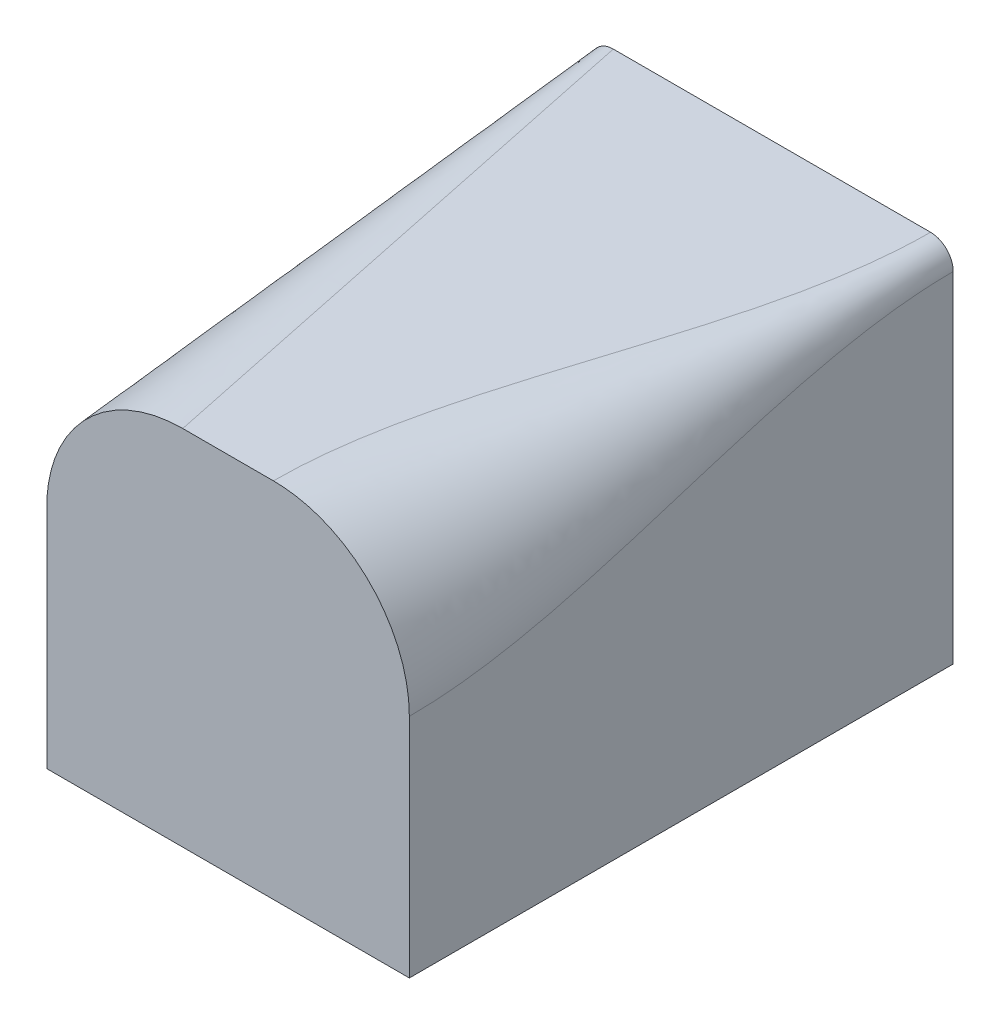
ISO-10303-21;
HEADER;
FILE_DESCRIPTION(('STEP AP214'),'2;1');
FILE_NAME('part.step','',(''),(''),'','','');
FILE_SCHEMA(('AUTOMOTIVE_DESIGN { 1 0 10303 214 1 1 1 1 }'));
ENDSEC;
DATA;
#1=APPLICATION_CONTEXT('core data for automotive mechanical design processes');
#2=APPLICATION_PROTOCOL_DEFINITION('international standard','automotive_design',2000,#1);
#3=PRODUCT_CONTEXT('',#1,'mechanical');
#4=PRODUCT('Part','Part','',(#3));
#5=PRODUCT_RELATED_PRODUCT_CATEGORY('part','',(#4));
#6=PRODUCT_DEFINITION_FORMATION('','',#4);
#7=PRODUCT_DEFINITION_CONTEXT('part definition',#1,'design');
#8=PRODUCT_DEFINITION('design','',#6,#7);
#9=PRODUCT_DEFINITION_SHAPE('','',#8);
#10=(LENGTH_UNIT() NAMED_UNIT(*) SI_UNIT(.MILLI.,.METRE.));
#11=(NAMED_UNIT(*) PLANE_ANGLE_UNIT() SI_UNIT($,.RADIAN.));
#12=(NAMED_UNIT(*) SI_UNIT($,.STERADIAN.) SOLID_ANGLE_UNIT());
#13=UNCERTAINTY_MEASURE_WITH_UNIT(LENGTH_MEASURE(1.E-05),#10,'distance_accuracy_value','');
#14=(GEOMETRIC_REPRESENTATION_CONTEXT(3) GLOBAL_UNCERTAINTY_ASSIGNED_CONTEXT((#13)) GLOBAL_UNIT_ASSIGNED_CONTEXT((#10,
#11,#12)) REPRESENTATION_CONTEXT('',''));
#15=CARTESIAN_POINT('',(0.,0.,0.));
#16=DIRECTION('',(0.,0.,1.));
#17=DIRECTION('',(1.,0.,0.));
#18=AXIS2_PLACEMENT_3D('',#15,#16,#17);
#19=CARTESIAN_POINT('',(25.4,0.,76.2));
#20=DIRECTION('',(-1.,0.,0.));
#21=DIRECTION('',(0.,-1.,0.));
#22=AXIS2_PLACEMENT_3D('',#19,#20,#21);
#23=PLANE('',#22);
#24=DIRECTION('',(0.,1.,0.));
#25=VECTOR('',#24,1.);
#26=CARTESIAN_POINT('',(25.4,0.,0.));
#27=LINE('',#26,#25);
#28=CARTESIAN_POINT('',(25.4,-50.8,0.));
#29=VERTEX_POINT('',#28);
#30=CARTESIAN_POINT('',(25.4,-3.17500000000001,0.));
#31=VERTEX_POINT('',#30);
#32=EDGE_CURVE('E124',#29,#31,#27,.T.);
#33=ORIENTED_EDGE('',*,*,#32,.T.);
#34=CARTESIAN_POINT('',(25.4,-19.05,228.6));
#35=CARTESIAN_POINT('',(25.4,-19.05,177.8));
#36=CARTESIAN_POINT('',(25.4,-19.05,127.));
#37=CARTESIAN_POINT('',(25.4,-19.05,76.2));
#38=CARTESIAN_POINT('',(25.4,-19.05,50.8));
#39=CARTESIAN_POINT('',(25.4,-3.17500000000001,25.4));
#40=CARTESIAN_POINT('',(25.4,-3.17500000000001,0.));
#41=CARTESIAN_POINT('',(25.4,-3.17500000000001,-50.7999999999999));
#42=CARTESIAN_POINT('',(25.4,-3.17500000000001,-101.6));
#43=CARTESIAN_POINT('',(25.4,-3.17500000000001,-152.4));
#44=(BOUNDED_CURVE() B_SPLINE_CURVE(3,(#34,#35,#36,#37,#38,#39,#40,#41,#42,#43),.UNSPECIFIED.,
.F.,.F.) B_SPLINE_CURVE_WITH_KNOTS((4,3,3,4),(-0.1524,0.,0.0762,0.2286),
.UNSPECIFIED.) CURVE() GEOMETRIC_REPRESENTATION_ITEM() RATIONAL_B_SPLINE_CURVE((1.,1.,1.,1.,1.,
1.,1.,1.,1.,1.)) REPRESENTATION_ITEM(''));
#45=CARTESIAN_POINT('',(25.4,-19.05,76.2));
#46=VERTEX_POINT('',#45);
#47=EDGE_CURVE('E51',#31,#46,#44,.F.);
#48=ORIENTED_EDGE('',*,*,#47,.T.);
#49=DIRECTION('',(0.,1.,0.));
#50=VECTOR('',#49,1.);
#51=CARTESIAN_POINT('',(25.4,0.,76.2));
#52=LINE('',#51,#50);
#53=CARTESIAN_POINT('',(25.4,-50.8,76.2));
#54=VERTEX_POINT('',#53);
#55=EDGE_CURVE('E130',#54,#46,#52,.T.);
#56=ORIENTED_EDGE('',*,*,#55,.F.);
#57=DIRECTION('',(0.,0.,-1.));
#58=VECTOR('',#57,1.);
#59=CARTESIAN_POINT('',(25.4,-50.8,76.2));
#60=LINE('',#59,#58);
#61=EDGE_CURVE('E116',#54,#29,#60,.T.);
#62=ORIENTED_EDGE('',*,*,#61,.T.);
#63=EDGE_LOOP('',(#33,#48,#56,#62));
#64=FACE_BOUND('',#63,.T.);
#65=ADVANCED_FACE('F34',(#64),#23,.F.);
#66=CARTESIAN_POINT('',(25.4,0.,76.2));
#67=DIRECTION('',(0.,-1.,0.));
#68=DIRECTION('',(1.,0.,0.));
#69=AXIS2_PLACEMENT_3D('',#66,#67,#68);
#70=PLANE('',#69);
#71=DIRECTION('',(-1.,0.,0.));
#72=VECTOR('',#71,1.);
#73=CARTESIAN_POINT('',(25.4,0.,76.2));
#74=LINE('',#73,#72);
#75=CARTESIAN_POINT('',(6.35000000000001,0.,76.2));
#76=VERTEX_POINT('',#75);
#77=CARTESIAN_POINT('',(-6.35,0.,76.2));
#78=VERTEX_POINT('',#77);
#79=EDGE_CURVE('E106',#76,#78,#74,.T.);
#80=ORIENTED_EDGE('',*,*,#79,.F.);
#81=CARTESIAN_POINT('',(6.35000000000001,0.,228.6));
#82=CARTESIAN_POINT('',(6.35000000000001,0.,177.8));
#83=CARTESIAN_POINT('',(6.35000000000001,0.,127.));
#84=CARTESIAN_POINT('',(6.35000000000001,0.,76.2));
#85=CARTESIAN_POINT('',(6.35000000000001,0.,50.8));
#86=CARTESIAN_POINT('',(22.225,0.,25.4));
#87=CARTESIAN_POINT('',(22.225,0.,0.));
#88=CARTESIAN_POINT('',(22.225,0.,-50.7999999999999));
#89=CARTESIAN_POINT('',(22.225,0.,-101.6));
#90=CARTESIAN_POINT('',(22.225,0.,-152.4));
#91=(BOUNDED_CURVE() B_SPLINE_CURVE(3,(#81,#82,#83,#84,#85,#86,#87,#88,#89,#90),.UNSPECIFIED.,
.F.,.F.) B_SPLINE_CURVE_WITH_KNOTS((4,3,3,4),(-0.1524,0.,0.0762,0.2286),
.UNSPECIFIED.) CURVE() GEOMETRIC_REPRESENTATION_ITEM() RATIONAL_B_SPLINE_CURVE((1.,1.,1.,1.,1.,
1.,1.,1.,1.,1.)) REPRESENTATION_ITEM(''));
#92=CARTESIAN_POINT('',(22.225,0.,0.));
#93=VERTEX_POINT('',#92);
#94=EDGE_CURVE('E175',#76,#93,#91,.T.);
#95=ORIENTED_EDGE('',*,*,#94,.T.);
#96=DIRECTION('',(-1.,0.,0.));
#97=VECTOR('',#96,1.);
#98=CARTESIAN_POINT('',(25.4,0.,0.));
#99=LINE('',#98,#97);
#100=CARTESIAN_POINT('',(-22.225,0.,0.));
#101=VERTEX_POINT('',#100);
#102=EDGE_CURVE('E126',#93,#101,#99,.T.);
#103=ORIENTED_EDGE('',*,*,#102,.T.);
#104=CARTESIAN_POINT('',(25.4,0.,228.6));
#105=CARTESIAN_POINT('',(14.8166666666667,0.,177.8));
#106=CARTESIAN_POINT('',(4.23333333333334,0.,127.));
#107=CARTESIAN_POINT('',(-6.35,0.,76.2));
#108=CARTESIAN_POINT('',(-11.6416666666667,0.,50.8));
#109=CARTESIAN_POINT('',(-16.9333333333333,0.,25.4));
#110=CARTESIAN_POINT('',(-22.225,0.,0.));
#111=CARTESIAN_POINT('',(-23.2833333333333,0.,-5.07999999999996));
#112=CARTESIAN_POINT('',(-24.3416666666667,0.,-10.16));
#113=CARTESIAN_POINT('',(-25.4,0.,-15.24));
#114=(BOUNDED_CURVE() B_SPLINE_CURVE(3,(#104,#105,#106,#107,#108,#109,#110,#111,#112,#113),
.UNSPECIFIED.,.F.,.F.) B_SPLINE_CURVE_WITH_KNOTS((4,3,3,4),(-0.1524,0.,0.0762,0.09144),
.UNSPECIFIED.) CURVE() GEOMETRIC_REPRESENTATION_ITEM() RATIONAL_B_SPLINE_CURVE((1.,1.,1.,1.,1.,
1.,1.,1.,1.,1.)) REPRESENTATION_ITEM(''));
#115=EDGE_CURVE('E146',#101,#78,#114,.F.);
#116=ORIENTED_EDGE('',*,*,#115,.T.);
#117=EDGE_LOOP('',(#80,#95,#103,#116));
#118=FACE_BOUND('',#117,.T.);
#119=ADVANCED_FACE('F187',(#118),#70,.F.);
#120=CARTESIAN_POINT('',(-25.4,0.,76.2));
#121=DIRECTION('',(1.,0.,0.));
#122=DIRECTION('',(0.,1.,0.));
#123=AXIS2_PLACEMENT_3D('',#120,#121,#122);
#124=PLANE('',#123);
#125=DIRECTION('',(0.,-1.,0.));
#126=VECTOR('',#125,1.);
#127=CARTESIAN_POINT('',(-25.4,0.,76.2));
#128=LINE('',#127,#126);
#129=CARTESIAN_POINT('',(-25.4,-19.05,76.2));
#130=VERTEX_POINT('',#129);
#131=CARTESIAN_POINT('',(-25.4,-50.8,76.2));
#132=VERTEX_POINT('',#131);
#133=EDGE_CURVE('E95',#130,#132,#128,.T.);
#134=ORIENTED_EDGE('',*,*,#133,.F.);
#135=CARTESIAN_POINT('',(-25.4,-50.8,228.6));
#136=CARTESIAN_POINT('',(-25.4,-40.2166666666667,177.8));
#137=CARTESIAN_POINT('',(-25.4,-29.6333333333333,127.));
#138=CARTESIAN_POINT('',(-25.4,-19.05,76.2));
#139=CARTESIAN_POINT('',(-25.4,-13.7583333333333,50.8));
#140=CARTESIAN_POINT('',(-25.4,-8.46666666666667,25.4));
#141=CARTESIAN_POINT('',(-25.4,-3.175,0.));
#142=CARTESIAN_POINT('',(-25.4,-2.11666666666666,-5.07999999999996));
#143=CARTESIAN_POINT('',(-25.4,-1.05833333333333,-10.16));
#144=CARTESIAN_POINT('',(-25.4,0.,-15.24));
#145=(BOUNDED_CURVE() B_SPLINE_CURVE(3,(#135,#136,#137,#138,#139,#140,#141,#142,#143,#144),
.UNSPECIFIED.,.F.,.F.) B_SPLINE_CURVE_WITH_KNOTS((4,3,3,4),(-0.1524,0.,0.0762,0.09144),
.UNSPECIFIED.) CURVE() GEOMETRIC_REPRESENTATION_ITEM() RATIONAL_B_SPLINE_CURVE((1.,1.,1.,1.,1.,
1.,1.,1.,1.,1.)) REPRESENTATION_ITEM(''));
#146=CARTESIAN_POINT('',(-25.4,-3.175,0.));
#147=VERTEX_POINT('',#146);
#148=EDGE_CURVE('E115',#130,#147,#145,.T.);
#149=ORIENTED_EDGE('',*,*,#148,.T.);
#150=DIRECTION('',(0.,-1.,0.));
#151=VECTOR('',#150,1.);
#152=CARTESIAN_POINT('',(-25.4,0.,0.));
#153=LINE('',#152,#151);
#154=CARTESIAN_POINT('',(-25.4,-50.8,0.));
#155=VERTEX_POINT('',#154);
#156=EDGE_CURVE('E112',#147,#155,#153,.T.);
#157=ORIENTED_EDGE('',*,*,#156,.T.);
#158=DIRECTION('',(0.,0.,-1.));
#159=VECTOR('',#158,1.);
#160=CARTESIAN_POINT('',(-25.4,-50.8,76.2));
#161=LINE('',#160,#159);
#162=EDGE_CURVE('E109',#132,#155,#161,.T.);
#163=ORIENTED_EDGE('',*,*,#162,.F.);
#164=EDGE_LOOP('',(#134,#149,#157,#163));
#165=FACE_BOUND('',#164,.T.);
#166=ADVANCED_FACE('F110',(#165),#124,.F.);
#167=CARTESIAN_POINT('',(25.4,-50.8,76.2));
#168=DIRECTION('',(0.,1.,0.));
#169=DIRECTION('',(0.,0.,1.));
#170=AXIS2_PLACEMENT_3D('',#167,#168,#169);
#171=PLANE('',#170);
#172=DIRECTION('',(1.,0.,0.));
#173=VECTOR('',#172,1.);
#174=CARTESIAN_POINT('',(25.4,-50.8,0.));
#175=LINE('',#174,#173);
#176=EDGE_CURVE('E129',#155,#29,#175,.T.);
#177=ORIENTED_EDGE('',*,*,#176,.T.);
#178=ORIENTED_EDGE('',*,*,#61,.F.);
#179=DIRECTION('',(1.,0.,0.));
#180=VECTOR('',#179,1.);
#181=CARTESIAN_POINT('',(25.4,-50.8,76.2));
#182=LINE('',#181,#180);
#183=EDGE_CURVE('E99',#132,#54,#182,.T.);
#184=ORIENTED_EDGE('',*,*,#183,.F.);
#185=ORIENTED_EDGE('',*,*,#162,.T.);
#186=EDGE_LOOP('',(#177,#178,#184,#185));
#187=FACE_BOUND('',#186,.T.);
#188=ADVANCED_FACE('F118',(#187),#171,.F.);
#189=CARTESIAN_POINT('',(0.,0.,76.2));
#190=DIRECTION('',(0.,0.,-1.));
#191=DIRECTION('',(-1.,0.,0.));
#192=AXIS2_PLACEMENT_3D('',#189,#190,#191);
#193=PLANE('',#192);
#194=ORIENTED_EDGE('',*,*,#55,.T.);
#195=CARTESIAN_POINT('',(25.4,-19.05,76.2));
#196=CARTESIAN_POINT('',(25.4000113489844,-18.6927966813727,76.2));
#197=CARTESIAN_POINT('',(25.389953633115,-18.335594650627,76.2));
#198=CARTESIAN_POINT('',(25.3497827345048,-17.6223369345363,76.2));
#199=CARTESIAN_POINT('',(25.319670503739,-17.2662811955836,76.2));
#200=CARTESIAN_POINT('',(25.2394738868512,-16.556431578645,76.2));
#201=CARTESIAN_POINT('',(25.1893898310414,-16.2026376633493,76.2));
#202=CARTESIAN_POINT('',(25.0694573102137,-15.4986904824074,76.2));
#203=CARTESIAN_POINT('',(24.9996236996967,-15.1485346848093,76.2));
#204=CARTESIAN_POINT('',(24.8403945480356,-14.452698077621,76.2));
#205=CARTESIAN_POINT('',(24.7509992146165,-14.1070172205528,76.2));
#206=CARTESIAN_POINT('',(24.5529392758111,-13.4212427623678,76.2));
#207=CARTESIAN_POINT('',(24.4442747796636,-13.0811491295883,76.2));
#208=CARTESIAN_POINT('',(24.1488633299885,-12.2390045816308,76.2));
#209=CARTESIAN_POINT('',(23.9502531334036,-11.7410674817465,76.2));
#210=CARTESIAN_POINT('',(23.5117400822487,-10.7636182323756,76.2));
#211=CARTESIAN_POINT('',(23.2718317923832,-10.2841085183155,76.2));
#212=CARTESIAN_POINT('',(22.8823933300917,-9.58140723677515,76.2));
#213=CARTESIAN_POINT('',(22.7476419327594,-9.34992023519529,76.2));
#214=CARTESIAN_POINT('',(22.4685427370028,-8.89289631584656,76.2));
#215=CARTESIAN_POINT('',(22.3241976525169,-8.66735774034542,76.2));
#216=CARTESIAN_POINT('',(21.8770571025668,-8.00013217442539,76.2));
#217=CARTESIAN_POINT('',(21.5601337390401,-7.56779457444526,76.2));
#218=CARTESIAN_POINT('',(20.8910392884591,-6.73141334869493,76.2));
#219=CARTESIAN_POINT('',(20.5388685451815,-6.32736944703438,76.2));
#220=CARTESIAN_POINT('',(19.8017316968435,-5.55036485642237,76.2));
#221=CARTESIAN_POINT('',(19.4167654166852,-5.17740433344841,76.2));
#222=CARTESIAN_POINT('',(18.616707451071,-4.46516864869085,76.2));
#223=CARTESIAN_POINT('',(18.2016097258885,-4.12590027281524,76.2));
#224=CARTESIAN_POINT('',(17.3443119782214,-3.48354608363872,76.2));
#225=CARTESIAN_POINT('',(16.9021123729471,-3.18045971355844,76.2));
#226=CARTESIAN_POINT('',(15.9936728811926,-2.61257110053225,76.2));
#227=CARTESIAN_POINT('',(15.5274288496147,-2.34777548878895,76.2));
#228=CARTESIAN_POINT('',(14.574253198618,-1.85839820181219,76.2));
#229=CARTESIAN_POINT('',(14.0873203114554,-1.63381899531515,76.2));
#230=CARTESIAN_POINT('',(13.0965218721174,-1.22659650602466,76.2));
#231=CARTESIAN_POINT('',(12.592664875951,-1.04393238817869,76.2));
#232=CARTESIAN_POINT('',(11.571428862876,-0.72172359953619,76.2));
#233=CARTESIAN_POINT('',(11.0540531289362,-0.582168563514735,76.2));
#234=CARTESIAN_POINT('',(10.1887583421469,-0.387466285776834,76.2));
#235=CARTESIAN_POINT('',(9.8436042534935,-0.319786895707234,76.2));
#236=CARTESIAN_POINT('',(9.1500851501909,-0.203631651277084,76.2));
#237=CARTESIAN_POINT('',(8.80172038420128,-0.155154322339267,76.2));
#238=CARTESIAN_POINT('',(8.10336811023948,-0.0776140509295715,76.2));
#239=CARTESIAN_POINT('',(7.75338379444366,-0.0485222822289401,76.2));
#240=CARTESIAN_POINT('',(7.05226771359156,-0.00970815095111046,76.2));
#241=CARTESIAN_POINT('',(6.70113571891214,1.00633586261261E-05,76.2));
#242=CARTESIAN_POINT('',(6.35000000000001,0.,76.2));
#243=B_SPLINE_CURVE_WITH_KNOTS('',3,(#195,#196,#197,#198,#199,#200,#201,#202,#203,#204,#205,
#206,#207,#208,#209,#210,#211,#212,#213,#214,#215,#216,#217,#218,#219,#220,#221,#222,#223,#224,
#225,#226,#227,#228,#229,#230,#231,#232,#233,#234,#235,#236,#237,#238,#239,#240,#241,#242),
.UNSPECIFIED.,.F.,.F.,(4,2,2,2,2,2,2,2,2,2,2,2,2,2,2,2,2,2,2,2,2,2,2,4),(0.,1.07146645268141,
2.14288204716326,3.21427992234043,4.28487408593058,5.35545688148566,6.42603360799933,
8.03231336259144,9.63880468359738,10.4421496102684,11.2452682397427,12.8513661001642,
14.4574482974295,16.0635390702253,17.6699526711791,19.2763415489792,20.8830082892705,
22.4897736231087,24.0957385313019,25.7013169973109,26.7560101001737,27.8106221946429,
28.8636625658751,29.9169283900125),.UNSPECIFIED.);
#244=EDGE_CURVE('E11',#46,#76,#243,.T.);
#245=ORIENTED_EDGE('',*,*,#244,.T.);
#246=ORIENTED_EDGE('',*,*,#79,.T.);
#247=CARTESIAN_POINT('',(-6.35,0.,76.2));
#248=CARTESIAN_POINT('',(-6.70720331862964,1.13489927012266E-05,76.2));
#249=CARTESIAN_POINT('',(-7.06440534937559,-0.0100463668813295,76.2));
#250=CARTESIAN_POINT('',(-7.77766306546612,-0.0502172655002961,76.2));
#251=CARTESIAN_POINT('',(-8.13371880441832,-0.0803294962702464,76.2));
#252=CARTESIAN_POINT('',(-8.8435684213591,-0.160526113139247,76.2));
#253=CARTESIAN_POINT('',(-9.19736233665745,-0.210610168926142,76.2));
#254=CARTESIAN_POINT('',(-9.90130951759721,-0.330542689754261,76.2));
#255=CARTESIAN_POINT('',(-10.2514653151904,-0.4003763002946,76.2));
#256=CARTESIAN_POINT('',(-10.9473019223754,-0.559605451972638,76.2));
#257=CARTESIAN_POINT('',(-11.2929827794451,-0.649000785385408,76.2));
#258=CARTESIAN_POINT('',(-11.9787572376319,-0.847060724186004,76.2));
#259=CARTESIAN_POINT('',(-12.3188508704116,-0.955725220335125,76.2));
#260=CARTESIAN_POINT('',(-13.1609954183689,-1.25113667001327,76.1999999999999));
#261=CARTESIAN_POINT('',(-13.6589325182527,-1.44974686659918,76.2));
#262=CARTESIAN_POINT('',(-14.6363817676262,-1.88825991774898,76.2));
#263=CARTESIAN_POINT('',(-15.1158914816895,-2.12816820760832,76.2));
#264=CARTESIAN_POINT('',(-15.8185927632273,-2.51760666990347,76.2));
#265=CARTESIAN_POINT('',(-16.0500797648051,-2.65235806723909,76.2));
#266=CARTESIAN_POINT('',(-16.5071036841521,-2.93145726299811,76.2));
#267=CARTESIAN_POINT('',(-16.7326422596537,-3.07580234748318,76.2));
#268=CARTESIAN_POINT('',(-17.3998678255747,-3.52294289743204,76.2));
#269=CARTESIAN_POINT('',(-17.8322054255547,-3.8398662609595,76.2));
#270=CARTESIAN_POINT('',(-18.668586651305,-4.50896071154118,76.2));
#271=CARTESIAN_POINT('',(-19.0726305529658,-4.86113145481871,76.2));
#272=CARTESIAN_POINT('',(-19.8496351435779,-5.59826830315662,76.2));
#273=CARTESIAN_POINT('',(-20.2225956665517,-5.98323458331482,76.2));
#274=CARTESIAN_POINT('',(-20.934831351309,-6.78329254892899,76.2));
#275=CARTESIAN_POINT('',(-21.2740997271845,-7.19839027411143,76.2));
#276=CARTESIAN_POINT('',(-21.9164539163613,-8.05568802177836,76.2));
#277=CARTESIAN_POINT('',(-22.219540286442,-8.49788762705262,76.2));
#278=CARTESIAN_POINT('',(-22.7874288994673,-9.40632711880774,76.2));
#279=CARTESIAN_POINT('',(-23.0522245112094,-9.87257115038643,76.2));
#280=CARTESIAN_POINT('',(-23.5416017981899,-10.8257468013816,76.2));
#281=CARTESIAN_POINT('',(-23.7661810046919,-11.3126796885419,76.2));
#282=CARTESIAN_POINT('',(-24.1734034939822,-12.3034781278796,76.2));
#283=CARTESIAN_POINT('',(-24.3560676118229,-12.8073351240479,76.2));
#284=CARTESIAN_POINT('',(-24.678276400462,-13.8285711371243,76.2));
#285=CARTESIAN_POINT('',(-24.8178314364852,-14.3459468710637,76.2));
#286=CARTESIAN_POINT('',(-25.0125337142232,-15.211241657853,76.2));
#287=CARTESIAN_POINT('',(-25.0802131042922,-15.5563957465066,76.2));
#288=CARTESIAN_POINT('',(-25.1963683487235,-16.2499148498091,76.2));
#289=CARTESIAN_POINT('',(-25.2448456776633,-16.5982796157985,76.2));
#290=CARTESIAN_POINT('',(-25.3223859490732,-17.2966318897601,76.2));
#291=CARTESIAN_POINT('',(-25.3514777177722,-17.646616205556,76.2));
#292=CARTESIAN_POINT('',(-25.3902918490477,-18.3477322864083,76.2));
#293=CARTESIAN_POINT('',(-25.4000100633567,-18.6988642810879,76.2));
#294=CARTESIAN_POINT('',(-25.4,-19.05,76.2));
#295=B_SPLINE_CURVE_WITH_KNOTS('',3,(#247,#248,#249,#250,#251,#252,#253,#254,#255,#256,#257,
#258,#259,#260,#261,#262,#263,#264,#265,#266,#267,#268,#269,#270,#271,#272,#273,#274,#275,#276,
#277,#278,#279,#280,#281,#282,#283,#284,#285,#286,#287,#288,#289,#290,#291,#292,#293,#294),
.UNSPECIFIED.,.F.,.F.,(4,2,2,2,2,2,2,2,2,2,2,2,2,2,2,2,2,2,2,2,2,2,2,4),(0.,1.07146645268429,
2.14288204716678,3.21427992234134,4.28487408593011,5.35545688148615,6.42603360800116,
8.03231336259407,9.6388046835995,10.4421496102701,11.2452682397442,12.8513661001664,
14.4574482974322,16.0635390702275,17.669952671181,19.2763415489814,20.8830082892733,
22.4897736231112,24.0957385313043,25.7013169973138,26.7560101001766,27.8106221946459,
28.8636625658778,29.9169283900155),.UNSPECIFIED.);
#296=EDGE_CURVE('E102',#78,#130,#295,.T.);
#297=ORIENTED_EDGE('',*,*,#296,.T.);
#298=ORIENTED_EDGE('',*,*,#133,.T.);
#299=ORIENTED_EDGE('',*,*,#183,.T.);
#300=EDGE_LOOP('',(#194,#245,#246,#297,#298,#299));
#301=FACE_BOUND('',#300,.T.);
#302=ADVANCED_FACE('F97',(#301),#193,.F.);
#303=CARTESIAN_POINT('',(0.,0.,0.));
#304=DIRECTION('',(0.,0.,-1.));
#305=DIRECTION('',(-1.,0.,0.));
#306=AXIS2_PLACEMENT_3D('',#303,#304,#305);
#307=PLANE('',#306);
#308=ORIENTED_EDGE('',*,*,#102,.F.);
#309=CARTESIAN_POINT('',(22.225,0.,0.));
#310=CARTESIAN_POINT('',(22.3143020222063,8.55675596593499E-06,0.));
#311=CARTESIAN_POINT('',(22.4035999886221,-0.00376761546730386,0.));
#312=CARTESIAN_POINT('',(22.5815570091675,-0.0188231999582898,0.));
#313=CARTESIAN_POINT('',(22.6702160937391,-0.0301022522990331,0.));
#314=CARTESIAN_POINT('',(22.8462067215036,-0.060086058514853,0.));
#315=CARTESIAN_POINT('',(22.9335392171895,-0.0787851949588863,0.));
#316=CARTESIAN_POINT('',(23.1062972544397,-0.123457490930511,0.));
#317=CARTESIAN_POINT('',(23.1917228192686,-0.149430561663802,0.));
#318=CARTESIAN_POINT('',(23.4443148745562,-0.238050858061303,1.42837030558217E-13));
#319=CARTESIAN_POINT('',(23.6078683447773,-0.311411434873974,0.));
#320=CARTESIAN_POINT('',(23.920217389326,-0.484501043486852,0.));
#321=CARTESIAN_POINT('',(24.0690155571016,-0.584225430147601,1.01374125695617E-13));
#322=CARTESIAN_POINT('',(24.3477824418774,-0.807245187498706,1.06792664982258E-13));
#323=CARTESIAN_POINT('',(24.4777513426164,-0.930540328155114,0.));
#324=CARTESIAN_POINT('',(24.7151644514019,-1.19722687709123,0.));
#325=CARTESIAN_POINT('',(24.8226042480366,-1.34062221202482,1.04893312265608E-13));
#326=CARTESIAN_POINT('',(25.0119009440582,-1.64343009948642,1.03273346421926E-13));
#327=CARTESIAN_POINT('',(25.0937528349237,-1.80284577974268,0.));
#328=CARTESIAN_POINT('',(25.22948832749,-2.13312474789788,0.));
#329=CARTESIAN_POINT('',(25.2833883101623,-2.30398126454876,1.18205812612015E-13));
#330=CARTESIAN_POINT('',(25.3482955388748,-2.5924027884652,0.));
#331=CARTESIAN_POINT('',(25.3676729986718,-2.70815340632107,0.));
#332=CARTESIAN_POINT('',(25.3935235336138,-2.94091984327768,0.));
#333=CARTESIAN_POINT('',(25.4000149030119,-3.05793363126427,0.));
#334=CARTESIAN_POINT('',(25.4,-3.17500000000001,1.04083408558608E-13));
#335=B_SPLINE_CURVE_WITH_KNOTS('',3,(#309,#310,#311,#312,#313,#314,#315,#316,#317,#318,#319,
#320,#321,#322,#323,#324,#325,#326,#327,#328,#329,#330,#331,#332,#333,#334),.UNSPECIFIED.,.F.,
.F.,(4,2,2,2,2,2,2,2,2,2,2,2,4),(0.,0.267818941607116,0.53562503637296,0.803228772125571,
1.07082924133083,1.60581494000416,2.14070644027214,2.67559272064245,3.21058363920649,
3.74567921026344,4.28046083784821,4.63187699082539,4.98279388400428),.UNSPECIFIED.);
#336=EDGE_CURVE('E65',#93,#31,#335,.T.);
#337=ORIENTED_EDGE('',*,*,#336,.T.);
#338=ORIENTED_EDGE('',*,*,#32,.F.);
#339=ORIENTED_EDGE('',*,*,#176,.F.);
#340=ORIENTED_EDGE('',*,*,#156,.F.);
#341=CARTESIAN_POINT('',(-25.4,-3.175,0.));
#342=CARTESIAN_POINT('',(-25.4000085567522,-3.08569797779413,0.));
#343=CARTESIAN_POINT('',(-25.3962323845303,-2.99640001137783,0.));
#344=CARTESIAN_POINT('',(-25.381176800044,-2.8184429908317,0.));
#345=CARTESIAN_POINT('',(-25.3698977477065,-2.72978390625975,0.));
#346=CARTESIAN_POINT('',(-25.3399139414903,-2.55379327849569,0.));
#347=CARTESIAN_POINT('',(-25.3212148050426,-2.46646078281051,0.));
#348=CARTESIAN_POINT('',(-25.2765425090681,-2.29370274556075,0.));
#349=CARTESIAN_POINT('',(-25.2505694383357,-2.20827718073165,0.));
#350=CARTESIAN_POINT('',(-25.1619491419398,-1.9556851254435,1.21417425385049E-13));
#351=CARTESIAN_POINT('',(-25.0885885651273,-1.79213165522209,0.));
#352=CARTESIAN_POINT('',(-24.9154989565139,-1.47978261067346,0.));
#353=CARTESIAN_POINT('',(-24.8157745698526,-1.33098444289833,0.));
#354=CARTESIAN_POINT('',(-24.5927548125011,-1.05221755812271,0.));
#355=CARTESIAN_POINT('',(-24.4694596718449,-0.922248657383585,0.));
#356=CARTESIAN_POINT('',(-24.2027731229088,-0.684835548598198,0.));
#357=CARTESIAN_POINT('',(-24.059377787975,-0.577395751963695,0.));
#358=CARTESIAN_POINT('',(-23.7565699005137,-0.388099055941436,0.));
#359=CARTESIAN_POINT('',(-23.5971542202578,-0.306247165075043,0.));
#360=CARTESIAN_POINT('',(-23.2668752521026,-0.170511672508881,0.));
#361=CARTESIAN_POINT('',(-23.0960187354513,-0.116611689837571,0.));
#362=CARTESIAN_POINT('',(-22.8075972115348,-0.0517044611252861,0.));
#363=CARTESIAN_POINT('',(-22.6918465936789,-0.0323270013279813,0.));
#364=CARTESIAN_POINT('',(-22.4590801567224,-0.00647646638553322,0.));
#365=CARTESIAN_POINT('',(-22.3420663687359,1.49030125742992E-05,-2.03888213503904E-13));
#366=CARTESIAN_POINT('',(-22.225,0.,-4.11129463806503E-13));
#367=B_SPLINE_CURVE_WITH_KNOTS('',3,(#341,#342,#343,#344,#345,#346,#347,#348,#349,#350,#351,
#352,#353,#354,#355,#356,#357,#358,#359,#360,#361,#362,#363,#364,#365,#366),.UNSPECIFIED.,.F.,
.F.,(4,2,2,2,2,2,2,2,2,2,2,2,4),(0.,0.267818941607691,0.535625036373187,0.803228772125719,
1.07082924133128,1.60581494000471,2.14070644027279,2.67559272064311,3.21058363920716,
3.74567921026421,4.28046083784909,4.63187699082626,4.98279388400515),.UNSPECIFIED.);
#368=EDGE_CURVE('E135',#147,#101,#367,.T.);
#369=ORIENTED_EDGE('',*,*,#368,.T.);
#370=EDGE_LOOP('',(#308,#337,#338,#339,#340,#369));
#371=FACE_BOUND('',#370,.T.);
#372=ADVANCED_FACE('F150',(#371),#307,.T.);
#373=CARTESIAN_POINT('',(-25.4,-22.225,91.4400000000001));
#374=CARTESIAN_POINT('',(-25.4,-21.1666666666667,86.3600000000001));
#375=CARTESIAN_POINT('',(-25.4,-20.1083333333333,81.28));
#376=CARTESIAN_POINT('',(-25.4,-19.05,76.2));
#377=CARTESIAN_POINT('',(-25.4,-13.7583333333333,50.8));
#378=CARTESIAN_POINT('',(-25.4,-8.46666666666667,25.4));
#379=CARTESIAN_POINT('',(-25.4,-3.175,0.));
#380=CARTESIAN_POINT('',(-25.4,-2.11666666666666,-5.07999999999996));
#381=CARTESIAN_POINT('',(-25.4,-1.05833333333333,-10.16));
#382=CARTESIAN_POINT('',(-25.4,0.,-15.24));
#383=CARTESIAN_POINT('',(-25.4,0.,91.4400000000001));
#384=CARTESIAN_POINT('',(-25.4,0.,86.3600000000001));
#385=CARTESIAN_POINT('',(-25.4,0.,81.28));
#386=CARTESIAN_POINT('',(-25.4,0.,76.2));
#387=CARTESIAN_POINT('',(-25.4,0.,50.8));
#388=CARTESIAN_POINT('',(-25.4,0.,25.4));
#389=CARTESIAN_POINT('',(-25.4,0.,0.));
#390=CARTESIAN_POINT('',(-25.4,0.,-5.07999999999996));
#391=CARTESIAN_POINT('',(-25.4,0.,-10.16));
#392=CARTESIAN_POINT('',(-25.4,0.,-15.24));
#393=CARTESIAN_POINT('',(-3.17499999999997,0.,91.4400000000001));
#394=CARTESIAN_POINT('',(-4.23333333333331,0.,86.3600000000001));
#395=CARTESIAN_POINT('',(-5.29166666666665,0.,81.28));
#396=CARTESIAN_POINT('',(-6.35,0.,76.2));
#397=CARTESIAN_POINT('',(-11.6416666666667,0.,50.8));
#398=CARTESIAN_POINT('',(-16.9333333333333,0.,25.4));
#399=CARTESIAN_POINT('',(-22.225,0.,0.));
#400=CARTESIAN_POINT('',(-23.2833333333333,0.,-5.07999999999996));
#401=CARTESIAN_POINT('',(-24.3416666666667,0.,-10.16));
#402=CARTESIAN_POINT('',(-25.4,0.,-15.24));
#403=(BOUNDED_SURFACE() B_SPLINE_SURFACE(2,3,((#373,#374,#375,#376,#377,#378,#379,#380,#381,
#382),(#383,#384,#385,#386,#387,#388,#389,#390,#391,#392),(#393,#394,#395,#396,#397,#398,#399,
#400,#401,#402)),.UNSPECIFIED.,.F.,.F.,.F.) B_SPLINE_SURFACE_WITH_KNOTS((3,3),(4,3,3,4),(0.,1.),
(-0.0152400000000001,0.,0.0762,0.09144),
.UNSPECIFIED.) GEOMETRIC_REPRESENTATION_ITEM() RATIONAL_B_SPLINE_SURFACE(((1.,1.,1.,1.,1.,1.,1.,
1.,1.,1.),(0.707106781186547,0.707106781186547,0.707106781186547,0.707106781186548,
0.707106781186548,0.707106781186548,0.707106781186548,0.707106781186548,0.707106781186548,
0.707106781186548),(1.,1.,1.,1.,1.,1.,1.,1.,1.,1.))) REPRESENTATION_ITEM('') SURFACE());
#404=ORIENTED_EDGE('',*,*,#296,.F.);
#405=ORIENTED_EDGE('',*,*,#115,.F.);
#406=ORIENTED_EDGE('',*,*,#368,.F.);
#407=ORIENTED_EDGE('',*,*,#148,.F.);
#408=EDGE_LOOP('',(#404,#405,#406,#407));
#409=FACE_BOUND('',#408,.T.);
#410=ADVANCED_FACE('F154',(#409),#403,.T.);
#411=CARTESIAN_POINT('',(6.35000000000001,0.,91.44));
#412=CARTESIAN_POINT('',(6.35000000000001,0.,86.36));
#413=CARTESIAN_POINT('',(6.35000000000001,0.,81.28));
#414=CARTESIAN_POINT('',(6.35000000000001,0.,76.2));
#415=CARTESIAN_POINT('',(6.35000000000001,0.,50.8));
#416=CARTESIAN_POINT('',(22.225,0.,25.4));
#417=CARTESIAN_POINT('',(22.225,0.,0.));
#418=CARTESIAN_POINT('',(22.225,0.,-5.07999999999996));
#419=CARTESIAN_POINT('',(22.225,0.,-10.16));
#420=CARTESIAN_POINT('',(22.225,0.,-15.24));
#421=CARTESIAN_POINT('',(25.4,0.,91.44));
#422=CARTESIAN_POINT('',(25.4,0.,86.36));
#423=CARTESIAN_POINT('',(25.4,0.,81.28));
#424=CARTESIAN_POINT('',(25.4,0.,76.2));
#425=CARTESIAN_POINT('',(25.4,0.,50.8));
#426=CARTESIAN_POINT('',(25.4,0.,25.4));
#427=CARTESIAN_POINT('',(25.4,0.,0.));
#428=CARTESIAN_POINT('',(25.4,0.,-5.07999999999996));
#429=CARTESIAN_POINT('',(25.4,0.,-10.16));
#430=CARTESIAN_POINT('',(25.4,0.,-15.24));
#431=CARTESIAN_POINT('',(25.4,-19.05,91.44));
#432=CARTESIAN_POINT('',(25.4,-19.05,86.36));
#433=CARTESIAN_POINT('',(25.4,-19.05,81.28));
#434=CARTESIAN_POINT('',(25.4,-19.05,76.2));
#435=CARTESIAN_POINT('',(25.4,-19.05,50.8));
#436=CARTESIAN_POINT('',(25.4,-3.17500000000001,25.4));
#437=CARTESIAN_POINT('',(25.4,-3.17500000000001,0.));
#438=CARTESIAN_POINT('',(25.4,-3.17500000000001,-5.07999999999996));
#439=CARTESIAN_POINT('',(25.4,-3.17500000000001,-10.16));
#440=CARTESIAN_POINT('',(25.4,-3.17500000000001,-15.24));
#441=(BOUNDED_SURFACE() B_SPLINE_SURFACE(2,3,((#411,#412,#413,#414,#415,#416,#417,#418,#419,
#420),(#421,#422,#423,#424,#425,#426,#427,#428,#429,#430),(#431,#432,#433,#434,#435,#436,#437,
#438,#439,#440)),.UNSPECIFIED.,.F.,.F.,.F.) B_SPLINE_SURFACE_WITH_KNOTS((3,3),(4,3,3,4),(0.,1.),
(-0.01524,0.,0.0762,0.09144),
.UNSPECIFIED.) GEOMETRIC_REPRESENTATION_ITEM() RATIONAL_B_SPLINE_SURFACE(((1.,1.,1.,1.,1.,1.,1.,
1.,1.,1.),(0.707106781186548,0.707106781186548,0.707106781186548,0.707106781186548,
0.707106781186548,0.707106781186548,0.707106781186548,0.707106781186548,0.707106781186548,
0.707106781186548),(1.,1.,1.,1.,1.,1.,1.,1.,1.,1.))) REPRESENTATION_ITEM('') SURFACE());
#442=ORIENTED_EDGE('',*,*,#244,.F.);
#443=ORIENTED_EDGE('',*,*,#47,.F.);
#444=ORIENTED_EDGE('',*,*,#336,.F.);
#445=ORIENTED_EDGE('',*,*,#94,.F.);
#446=EDGE_LOOP('',(#442,#443,#444,#445));
#447=FACE_BOUND('',#446,.T.);
#448=ADVANCED_FACE('F37',(#447),#441,.T.);
#449=CLOSED_SHELL('',(#65,#119,#166,#188,#302,#372,#410,#448));
#450=MANIFOLD_SOLID_BREP('B2',#449);
#451=ADVANCED_BREP_SHAPE_REPRESENTATION('',(#18,#450),#14);
#452=SHAPE_DEFINITION_REPRESENTATION(#9,#451);
ENDSEC;
END-ISO-10303-21;
